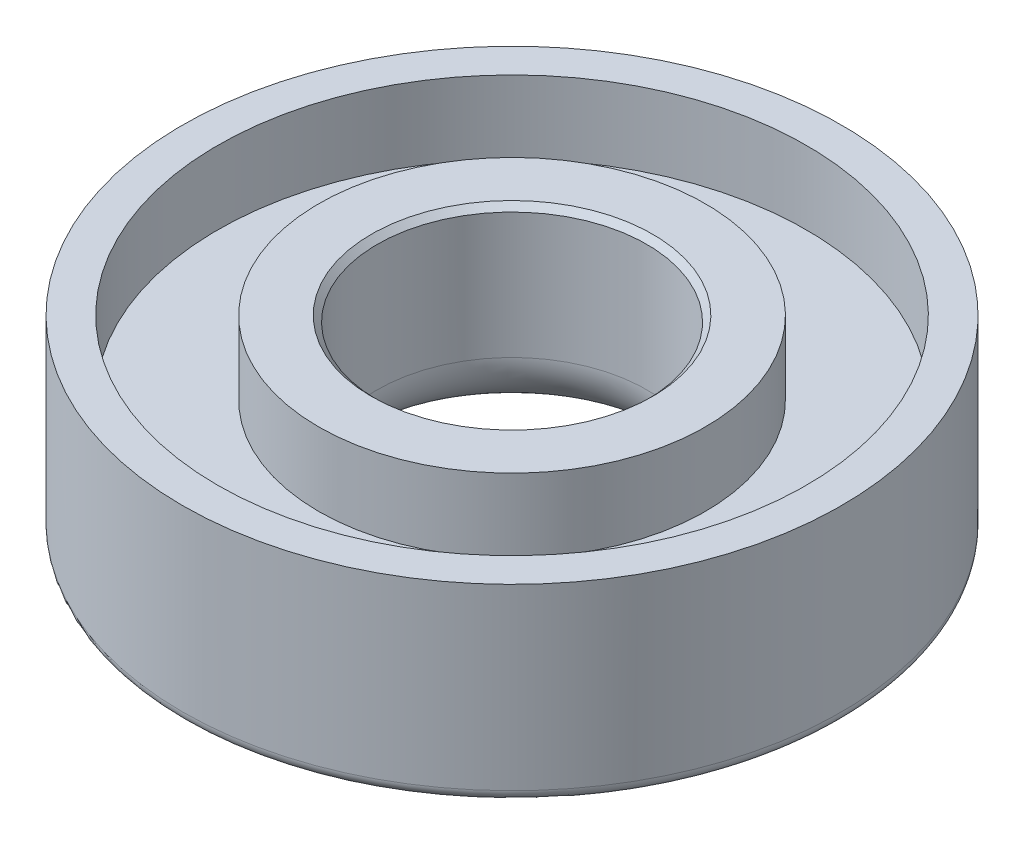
ISO-10303-21;
HEADER;
FILE_DESCRIPTION(('STEP AP214'),'2;1');
FILE_NAME('part.step','',(''),(''),'','','');
FILE_SCHEMA(('AUTOMOTIVE_DESIGN { 1 0 10303 214 1 1 1 1 }'));
ENDSEC;
DATA;
#1=APPLICATION_CONTEXT('core data for automotive mechanical design processes');
#2=APPLICATION_PROTOCOL_DEFINITION('international standard','automotive_design',2000,#1);
#3=PRODUCT_CONTEXT('',#1,'mechanical');
#4=PRODUCT('Part','Part','',(#3));
#5=PRODUCT_RELATED_PRODUCT_CATEGORY('part','',(#4));
#6=PRODUCT_DEFINITION_FORMATION('','',#4);
#7=PRODUCT_DEFINITION_CONTEXT('part definition',#1,'design');
#8=PRODUCT_DEFINITION('design','',#6,#7);
#9=PRODUCT_DEFINITION_SHAPE('','',#8);
#10=(LENGTH_UNIT() NAMED_UNIT(*) SI_UNIT(.MILLI.,.METRE.));
#11=(NAMED_UNIT(*) PLANE_ANGLE_UNIT() SI_UNIT($,.RADIAN.));
#12=(NAMED_UNIT(*) SI_UNIT($,.STERADIAN.) SOLID_ANGLE_UNIT());
#13=UNCERTAINTY_MEASURE_WITH_UNIT(LENGTH_MEASURE(1.E-05),#10,'distance_accuracy_value','');
#14=(GEOMETRIC_REPRESENTATION_CONTEXT(3) GLOBAL_UNCERTAINTY_ASSIGNED_CONTEXT((#13)) GLOBAL_UNIT_ASSIGNED_CONTEXT((#10,
#11,#12)) REPRESENTATION_CONTEXT('',''));
#15=CARTESIAN_POINT('',(0.,0.,0.));
#16=DIRECTION('',(0.,0.,1.));
#17=DIRECTION('',(1.,0.,0.));
#18=AXIS2_PLACEMENT_3D('',#15,#16,#17);
#19=CARTESIAN_POINT('',(0.,4.,0.));
#20=DIRECTION('',(0.,1.,0.));
#21=DIRECTION('',(0.,0.,1.));
#22=AXIS2_PLACEMENT_3D('',#19,#20,#21);
#23=PLANE('',#22);
#24=CARTESIAN_POINT('',(0.,4.,0.));
#25=DIRECTION('',(0.,1.,0.));
#26=DIRECTION('',(0.,0.,1.));
#27=AXIS2_PLACEMENT_3D('',#24,#25,#26);
#28=CIRCLE('',#27,6.6);
#29=CARTESIAN_POINT('',(0.,4.,6.6));
#30=VERTEX_POINT('',#29);
#31=EDGE_CURVE('E153',#30,#30,#28,.T.);
#32=ORIENTED_EDGE('',*,*,#31,.F.);
#33=EDGE_LOOP('',(#32));
#34=FACE_BOUND('',#33,.T.);
#35=CARTESIAN_POINT('',(0.,4.,0.));
#36=DIRECTION('',(0.,1.,0.));
#37=DIRECTION('',(0.,0.,1.));
#38=AXIS2_PLACEMENT_3D('',#35,#36,#37);
#39=CIRCLE('',#38,10.05);
#40=CARTESIAN_POINT('',(0.,4.,10.05));
#41=VERTEX_POINT('',#40);
#42=EDGE_CURVE('E162',#41,#41,#39,.T.);
#43=ORIENTED_EDGE('',*,*,#42,.T.);
#44=EDGE_LOOP('',(#43));
#45=FACE_BOUND('',#44,.T.);
#46=ADVANCED_FACE('F17',(#34,#45),#23,.T.);
#47=CARTESIAN_POINT('',(0.,6.5,0.));
#48=DIRECTION('',(0.,1.,0.));
#49=DIRECTION('',(0.,0.,1.));
#50=AXIS2_PLACEMENT_3D('',#47,#48,#49);
#51=CYLINDRICAL_SURFACE('',#50,6.6);
#52=ORIENTED_EDGE('',*,*,#31,.T.);
#53=EDGE_LOOP('',(#52));
#54=FACE_BOUND('',#53,.T.);
#55=CARTESIAN_POINT('',(0.,6.5,0.));
#56=DIRECTION('',(0.,1.,0.));
#57=DIRECTION('',(0.,0.,1.));
#58=AXIS2_PLACEMENT_3D('',#55,#56,#57);
#59=CIRCLE('',#58,6.6);
#60=CARTESIAN_POINT('',(0.,6.5,6.6));
#61=VERTEX_POINT('',#60);
#62=EDGE_CURVE('E165',#61,#61,#59,.T.);
#63=ORIENTED_EDGE('',*,*,#62,.F.);
#64=EDGE_LOOP('',(#63));
#65=FACE_BOUND('',#64,.T.);
#66=ADVANCED_FACE('F98',(#54,#65),#51,.T.);
#67=CARTESIAN_POINT('',(0.,6.5,0.));
#68=DIRECTION('',(0.,1.,0.));
#69=DIRECTION('',(0.,0.,1.));
#70=AXIS2_PLACEMENT_3D('',#67,#68,#69);
#71=CYLINDRICAL_SURFACE('',#70,10.05);
#72=ORIENTED_EDGE('',*,*,#42,.F.);
#73=EDGE_LOOP('',(#72));
#74=FACE_BOUND('',#73,.T.);
#75=CARTESIAN_POINT('',(0.,6.5,0.));
#76=DIRECTION('',(0.,1.,0.));
#77=DIRECTION('',(0.,0.,1.));
#78=AXIS2_PLACEMENT_3D('',#75,#76,#77);
#79=CIRCLE('',#78,10.05);
#80=CARTESIAN_POINT('',(0.,6.5,10.05));
#81=VERTEX_POINT('',#80);
#82=EDGE_CURVE('E168',#81,#81,#79,.F.);
#83=ORIENTED_EDGE('',*,*,#82,.F.);
#84=EDGE_LOOP('',(#83));
#85=FACE_BOUND('',#84,.T.);
#86=ADVANCED_FACE('F95',(#74,#85),#71,.F.);
#87=CARTESIAN_POINT('',(0.,6.5,0.));
#88=DIRECTION('',(0.,1.,0.));
#89=DIRECTION('',(0.,0.,1.));
#90=AXIS2_PLACEMENT_3D('',#87,#88,#89);
#91=PLANE('',#90);
#92=CARTESIAN_POINT('',(0.,6.50000053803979,0.));
#93=DIRECTION('',(0.,1.,0.));
#94=DIRECTION('',(0.,0.,1.));
#95=AXIS2_PLACEMENT_3D('',#92,#93,#94);
#96=CIRCLE('',#95,4.79999690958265);
#97=CARTESIAN_POINT('',(0.,6.50000053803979,4.79999690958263));
#98=VERTEX_POINT('',#97);
#99=EDGE_CURVE('E171',#98,#98,#96,.F.);
#100=ORIENTED_EDGE('',*,*,#99,.T.);
#101=EDGE_LOOP('',(#100));
#102=FACE_BOUND('',#101,.T.);
#103=ORIENTED_EDGE('',*,*,#62,.T.);
#104=EDGE_LOOP('',(#103));
#105=FACE_BOUND('',#104,.T.);
#106=ADVANCED_FACE('F91',(#102,#105),#91,.T.);
#107=CARTESIAN_POINT('',(0.,6.5,0.));
#108=DIRECTION('',(0.,1.,0.));
#109=DIRECTION('',(0.,0.,1.));
#110=AXIS2_PLACEMENT_3D('',#107,#108,#109);
#111=PLANE('',#110);
#112=ORIENTED_EDGE('',*,*,#82,.T.);
#113=EDGE_LOOP('',(#112));
#114=FACE_BOUND('',#113,.T.);
#115=CARTESIAN_POINT('',(0.,6.5,0.));
#116=DIRECTION('',(0.,1.,0.));
#117=DIRECTION('',(0.,0.,1.));
#118=AXIS2_PLACEMENT_3D('',#115,#116,#117);
#119=CIRCLE('',#118,11.25);
#120=CARTESIAN_POINT('',(0.,6.5,11.25));
#121=VERTEX_POINT('',#120);
#122=EDGE_CURVE('E174',#121,#121,#119,.F.);
#123=ORIENTED_EDGE('',*,*,#122,.F.);
#124=EDGE_LOOP('',(#123));
#125=FACE_BOUND('',#124,.T.);
#126=ADVANCED_FACE('F87',(#114,#125),#111,.T.);
#127=CARTESIAN_POINT('',(0.,6.50000053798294,0.));
#128=DIRECTION('',(0.,1.,0.));
#129=DIRECTION('',(0.,0.,1.));
#130=AXIS2_PLACEMENT_3D('',#127,#128,#129);
#131=CONICAL_SURFACE('',#130,4.7999969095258,0.78539778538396);
#132=CARTESIAN_POINT('',(0.,6.300002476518,0.));
#133=DIRECTION('',(0.,1.,0.));
#134=DIRECTION('',(0.,0.,1.));
#135=AXIS2_PLACEMENT_3D('',#132,#133,#134);
#136=CIRCLE('',#135,4.6);
#137=CARTESIAN_POINT('',(0.,6.300002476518,4.6));
#138=VERTEX_POINT('',#137);
#139=EDGE_CURVE('E177',#138,#138,#136,.F.);
#140=ORIENTED_EDGE('',*,*,#139,.T.);
#141=EDGE_LOOP('',(#140));
#142=FACE_BOUND('',#141,.T.);
#143=ORIENTED_EDGE('',*,*,#99,.F.);
#144=EDGE_LOOP('',(#143));
#145=FACE_BOUND('',#144,.T.);
#146=ADVANCED_FACE('F83',(#142,#145),#131,.F.);
#147=CARTESIAN_POINT('',(0.,0.,0.));
#148=DIRECTION('',(0.,1.,0.));
#149=DIRECTION('',(0.,0.,1.));
#150=AXIS2_PLACEMENT_3D('',#147,#148,#149);
#151=CYLINDRICAL_SURFACE('',#150,11.25);
#152=ORIENTED_EDGE('',*,*,#122,.T.);
#153=EDGE_LOOP('',(#152));
#154=FACE_BOUND('',#153,.T.);
#155=CARTESIAN_POINT('',(0.,0.4,0.));
#156=DIRECTION('',(0.,1.,0.));
#157=DIRECTION('',(-0.00630559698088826,0.,-0.999980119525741));
#158=AXIS2_PLACEMENT_3D('',#155,#156,#157);
#159=CIRCLE('',#158,11.25);
#160=CARTESIAN_POINT('',(-0.0709379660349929,0.4,-11.2497763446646));
#161=VERTEX_POINT('',#160);
#162=EDGE_CURVE('E179',#161,#161,#159,.F.);
#163=ORIENTED_EDGE('',*,*,#162,.F.);
#164=EDGE_LOOP('',(#163));
#165=FACE_BOUND('',#164,.T.);
#166=ADVANCED_FACE('F79',(#154,#165),#151,.T.);
#167=CARTESIAN_POINT('',(0.,6.5,0.));
#168=DIRECTION('',(0.,1.,0.));
#169=DIRECTION('',(0.,0.,1.));
#170=AXIS2_PLACEMENT_3D('',#167,#168,#169);
#171=CYLINDRICAL_SURFACE('',#170,4.6);
#172=CARTESIAN_POINT('',(0.,2.,0.));
#173=DIRECTION('',(0.,1.,0.));
#174=DIRECTION('',(-0.0108556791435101,0.,0.999941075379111));
#175=AXIS2_PLACEMENT_3D('',#172,#173,#174);
#176=CIRCLE('',#175,4.6);
#177=CARTESIAN_POINT('',(-0.0499361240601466,2.,4.59972894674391));
#178=VERTEX_POINT('',#177);
#179=EDGE_CURVE('E49',#178,#178,#176,.T.);
#180=ORIENTED_EDGE('',*,*,#179,.F.);
#181=EDGE_LOOP('',(#180));
#182=FACE_BOUND('',#181,.T.);
#183=ORIENTED_EDGE('',*,*,#139,.F.);
#184=EDGE_LOOP('',(#183));
#185=FACE_BOUND('',#184,.T.);
#186=ADVANCED_FACE('F71',(#182,#185),#171,.F.);
#187=CARTESIAN_POINT('',(0.,0.4,0.));
#188=DIRECTION('',(0.,1.,0.));
#189=DIRECTION('',(-0.00630559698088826,0.,-0.999980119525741));
#190=AXIS2_PLACEMENT_3D('',#187,#188,#189);
#191=TOROIDAL_SURFACE('',#190,10.85,0.4);
#192=ORIENTED_EDGE('',*,*,#162,.T.);
#193=EDGE_LOOP('',(#192));
#194=FACE_BOUND('',#193,.T.);
#195=CARTESIAN_POINT('',(0.,0.,0.));
#196=DIRECTION('',(0.,1.,0.));
#197=DIRECTION('',(0.,0.,1.));
#198=AXIS2_PLACEMENT_3D('',#195,#196,#197);
#199=CIRCLE('',#198,10.84999999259);
#200=CARTESIAN_POINT('',(0.,0.,10.849999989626));
#201=VERTEX_POINT('',#200);
#202=CARTESIAN_POINT('',(0.,0.,-10.849999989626));
#203=VERTEX_POINT('',#202);
#204=EDGE_CURVE('E42',#201,#203,#199,.T.);
#205=ORIENTED_EDGE('',*,*,#204,.T.);
#206=CARTESIAN_POINT('',(0.,0.,0.));
#207=DIRECTION('',(0.,1.,0.));
#208=DIRECTION('',(0.,0.,-1.));
#209=AXIS2_PLACEMENT_3D('',#206,#207,#208);
#210=CIRCLE('',#209,10.84999998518);
#211=EDGE_CURVE('E45',#203,#201,#210,.T.);
#212=ORIENTED_EDGE('',*,*,#211,.T.);
#213=EDGE_LOOP('',(#205,#212));
#214=FACE_BOUND('',#213,.T.);
#215=ADVANCED_FACE('F52',(#194,#214),#191,.T.);
#216=CARTESIAN_POINT('',(0.,2.,0.));
#217=DIRECTION('',(0.,1.,0.));
#218=DIRECTION('',(-0.0108556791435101,0.,0.999941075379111));
#219=AXIS2_PLACEMENT_3D('',#216,#217,#218);
#220=TOROIDAL_SURFACE('',#219,6.6,2.);
#221=ORIENTED_EDGE('',*,*,#179,.T.);
#222=EDGE_LOOP('',(#221));
#223=FACE_BOUND('',#222,.T.);
#224=CARTESIAN_POINT('',(0.,0.,0.));
#225=DIRECTION('',(0.,-1.,0.));
#226=DIRECTION('',(0.,0.,-1.));
#227=AXIS2_PLACEMENT_3D('',#224,#225,#226);
#228=CIRCLE('',#227,6.5999999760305);
#229=CARTESIAN_POINT('',(0.,0.,-6.5999999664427));
#230=VERTEX_POINT('',#229);
#231=CARTESIAN_POINT('',(0.,0.,6.5999999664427));
#232=VERTEX_POINT('',#231);
#233=EDGE_CURVE('E11',#230,#232,#228,.T.);
#234=ORIENTED_EDGE('',*,*,#233,.T.);
#235=CARTESIAN_POINT('',(0.,0.,0.));
#236=DIRECTION('',(0.,-1.,0.));
#237=DIRECTION('',(0.,0.,1.));
#238=AXIS2_PLACEMENT_3D('',#235,#236,#237);
#239=CIRCLE('',#238,6.599999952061);
#240=EDGE_CURVE('E28',#232,#230,#239,.T.);
#241=ORIENTED_EDGE('',*,*,#240,.T.);
#242=EDGE_LOOP('',(#234,#241));
#243=FACE_BOUND('',#242,.T.);
#244=ADVANCED_FACE('F70',(#223,#243),#220,.T.);
#245=CARTESIAN_POINT('',(0.,0.,0.));
#246=DIRECTION('',(0.,1.,0.));
#247=DIRECTION('',(0.,0.,1.));
#248=AXIS2_PLACEMENT_3D('',#245,#246,#247);
#249=PLANE('',#248);
#250=ORIENTED_EDGE('',*,*,#240,.F.);
#251=ORIENTED_EDGE('',*,*,#233,.F.);
#252=EDGE_LOOP('',(#250,#251));
#253=FACE_BOUND('',#252,.T.);
#254=ORIENTED_EDGE('',*,*,#211,.F.);
#255=ORIENTED_EDGE('',*,*,#204,.F.);
#256=EDGE_LOOP('',(#254,#255));
#257=FACE_BOUND('',#256,.T.);
#258=ADVANCED_FACE('F47',(#253,#257),#249,.F.);
#259=CLOSED_SHELL('',(#46,#66,#86,#106,#126,#146,#166,#186,#215,#244,#258));
#260=MANIFOLD_SOLID_BREP('B1',#259);
#261=ADVANCED_BREP_SHAPE_REPRESENTATION('',(#18,#260),#14);
#262=SHAPE_DEFINITION_REPRESENTATION(#9,#261);
ENDSEC;
END-ISO-10303-21;
